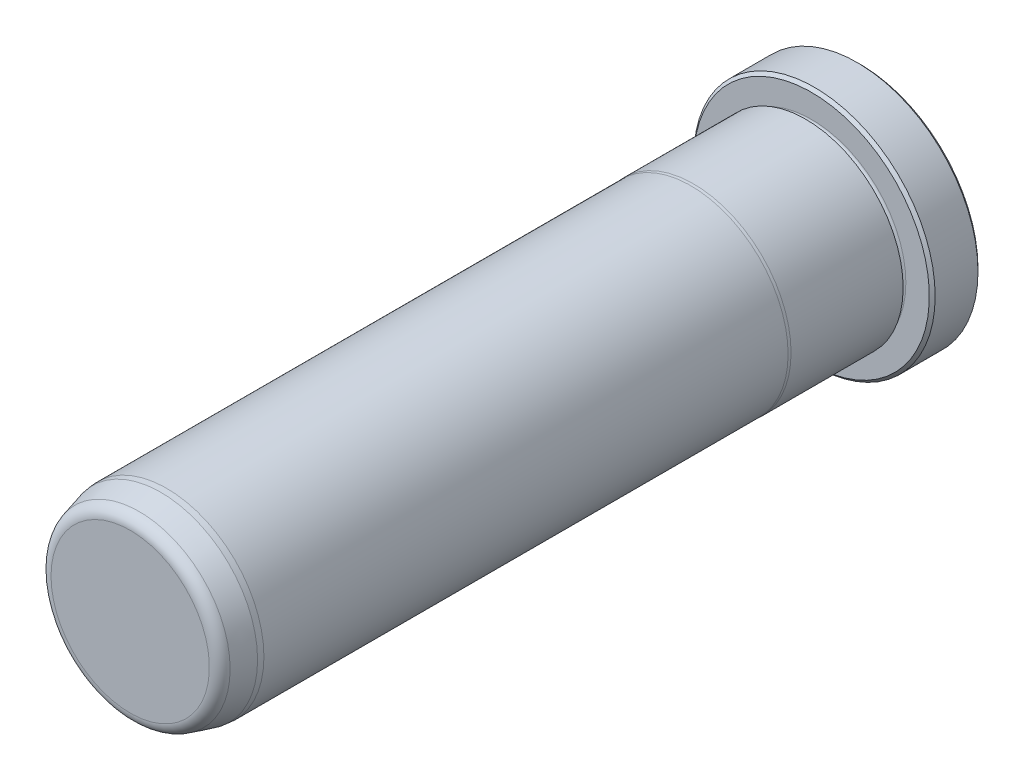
ISO-10303-21;
HEADER;
FILE_DESCRIPTION(('STEP AP214'),'2;1');
FILE_NAME('part.step','',(''),(''),'','','');
FILE_SCHEMA(('AUTOMOTIVE_DESIGN { 1 0 10303 214 1 1 1 1 }'));
ENDSEC;
DATA;
#1=APPLICATION_CONTEXT('core data for automotive mechanical design processes');
#2=APPLICATION_PROTOCOL_DEFINITION('international standard','automotive_design',2000,#1);
#3=PRODUCT_CONTEXT('',#1,'mechanical');
#4=PRODUCT('Part','Part','',(#3));
#5=PRODUCT_RELATED_PRODUCT_CATEGORY('part','',(#4));
#6=PRODUCT_DEFINITION_FORMATION('','',#4);
#7=PRODUCT_DEFINITION_CONTEXT('part definition',#1,'design');
#8=PRODUCT_DEFINITION('design','',#6,#7);
#9=PRODUCT_DEFINITION_SHAPE('','',#8);
#10=(LENGTH_UNIT() NAMED_UNIT(*) SI_UNIT(.MILLI.,.METRE.));
#11=(NAMED_UNIT(*) PLANE_ANGLE_UNIT() SI_UNIT($,.RADIAN.));
#12=(NAMED_UNIT(*) SI_UNIT($,.STERADIAN.) SOLID_ANGLE_UNIT());
#13=UNCERTAINTY_MEASURE_WITH_UNIT(LENGTH_MEASURE(1.E-05),#10,'distance_accuracy_value','');
#14=(GEOMETRIC_REPRESENTATION_CONTEXT(3) GLOBAL_UNCERTAINTY_ASSIGNED_CONTEXT((#13)) GLOBAL_UNIT_ASSIGNED_CONTEXT((#10,
#11,#12)) REPRESENTATION_CONTEXT('',''));
#15=CARTESIAN_POINT('',(0.,0.,0.));
#16=DIRECTION('',(0.,0.,1.));
#17=DIRECTION('',(1.,0.,0.));
#18=AXIS2_PLACEMENT_3D('',#15,#16,#17);
#19=CARTESIAN_POINT('',(0.,0.,0.));
#20=DIRECTION('',(0.,0.,1.));
#21=DIRECTION('',(1.,0.,0.));
#22=AXIS2_PLACEMENT_3D('',#19,#20,#21);
#23=PLANE('',#22);
#24=CARTESIAN_POINT('',(0.,0.,0.));
#25=DIRECTION('',(0.,0.,1.));
#26=DIRECTION('',(1.,0.,0.));
#27=AXIS2_PLACEMENT_3D('',#24,#25,#26);
#28=CIRCLE('',#27,15.367);
#29=CARTESIAN_POINT('',(15.367,0.,0.));
#30=VERTEX_POINT('',#29);
#31=EDGE_CURVE('E37',#30,#30,#28,.F.);
#32=ORIENTED_EDGE('',*,*,#31,.T.);
#33=EDGE_LOOP('',(#32));
#34=FACE_BOUND('',#33,.T.);
#35=ADVANCED_FACE('F30',(#34),#23,.F.);
#36=CARTESIAN_POINT('',(0.,0.,0.));
#37=DIRECTION('',(0.,0.,1.));
#38=DIRECTION('',(1.,0.,0.));
#39=AXIS2_PLACEMENT_3D('',#36,#37,#38);
#40=CYLINDRICAL_SURFACE('',#39,15.748);
#41=CARTESIAN_POINT('',(0.,0.,0.381000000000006));
#42=DIRECTION('',(0.,0.,1.));
#43=DIRECTION('',(1.,0.,0.));
#44=AXIS2_PLACEMENT_3D('',#41,#42,#43);
#45=CIRCLE('',#44,15.748);
#46=CARTESIAN_POINT('',(15.748,0.,0.381000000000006));
#47=VERTEX_POINT('',#46);
#48=EDGE_CURVE('E41',#47,#47,#45,.T.);
#49=ORIENTED_EDGE('',*,*,#48,.T.);
#50=EDGE_LOOP('',(#49));
#51=FACE_BOUND('',#50,.T.);
#52=CARTESIAN_POINT('',(0.,0.,5.96900000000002));
#53=DIRECTION('',(0.,0.,-1.));
#54=DIRECTION('',(-1.,0.,0.));
#55=AXIS2_PLACEMENT_3D('',#52,#53,#54);
#56=CIRCLE('',#55,15.748);
#57=CARTESIAN_POINT('',(-15.748,0.,5.96900000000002));
#58=VERTEX_POINT('',#57);
#59=EDGE_CURVE('E45',#58,#58,#56,.T.);
#60=ORIENTED_EDGE('',*,*,#59,.T.);
#61=EDGE_LOOP('',(#60));
#62=FACE_BOUND('',#61,.T.);
#63=ADVANCED_FACE('F118',(#51,#62),#40,.T.);
#64=CARTESIAN_POINT('',(0.,15.748,6.35));
#65=DIRECTION('',(0.,0.,-1.));
#66=DIRECTION('',(-1.,0.,0.));
#67=AXIS2_PLACEMENT_3D('',#64,#65,#66);
#68=PLANE('',#67);
#69=CARTESIAN_POINT('',(0.,0.,6.35));
#70=DIRECTION('',(0.,0.,-1.));
#71=DIRECTION('',(-1.,0.,0.));
#72=AXIS2_PLACEMENT_3D('',#69,#70,#71);
#73=CIRCLE('',#72,15.367);
#74=CARTESIAN_POINT('',(-15.367,0.,6.35));
#75=VERTEX_POINT('',#74);
#76=EDGE_CURVE('E10',#75,#75,#73,.F.);
#77=ORIENTED_EDGE('',*,*,#76,.T.);
#78=EDGE_LOOP('',(#77));
#79=FACE_BOUND('',#78,.T.);
#80=CARTESIAN_POINT('',(0.,0.,6.35));
#81=DIRECTION('',(0.,0.,1.));
#82=DIRECTION('',(1.,0.,0.));
#83=AXIS2_PLACEMENT_3D('',#80,#81,#82);
#84=CIRCLE('',#83,12.3063);
#85=CARTESIAN_POINT('',(12.3063,0.,6.35));
#86=VERTEX_POINT('',#85);
#87=EDGE_CURVE('E56',#86,#86,#84,.T.);
#88=ORIENTED_EDGE('',*,*,#87,.F.);
#89=EDGE_LOOP('',(#88));
#90=FACE_BOUND('',#89,.T.);
#91=ADVANCED_FACE('F113',(#79,#90),#68,.F.);
#92=CARTESIAN_POINT('',(0.,0.,6.731));
#93=DIRECTION('',(0.,0.,1.));
#94=DIRECTION('',(1.,0.,0.));
#95=AXIS2_PLACEMENT_3D('',#92,#93,#94);
#96=TOROIDAL_SURFACE('',#95,12.3063,0.381);
#97=CARTESIAN_POINT('',(0.,0.,7.112));
#98=DIRECTION('',(0.,0.,1.));
#99=DIRECTION('',(1.,0.,0.));
#100=AXIS2_PLACEMENT_3D('',#97,#98,#99);
#101=CIRCLE('',#100,12.3063);
#102=CARTESIAN_POINT('',(12.3063,0.,7.112));
#103=VERTEX_POINT('',#102);
#104=EDGE_CURVE('E59',#103,#103,#101,.T.);
#105=ORIENTED_EDGE('',*,*,#104,.F.);
#106=EDGE_LOOP('',(#105));
#107=FACE_BOUND('',#106,.T.);
#108=ORIENTED_EDGE('',*,*,#87,.T.);
#109=EDGE_LOOP('',(#108));
#110=FACE_BOUND('',#109,.T.);
#111=ADVANCED_FACE('F107',(#107,#110),#96,.F.);
#112=CARTESIAN_POINT('',(0.,12.3063,7.112));
#113=DIRECTION('',(0.,0.,1.));
#114=DIRECTION('',(1.,0.,0.));
#115=AXIS2_PLACEMENT_3D('',#112,#113,#114);
#116=PLANE('',#115);
#117=CARTESIAN_POINT('',(0.,0.,7.112));
#118=DIRECTION('',(0.,0.,1.));
#119=DIRECTION('',(1.,0.,0.));
#120=AXIS2_PLACEMENT_3D('',#117,#118,#119);
#121=CIRCLE('',#120,12.7127);
#122=CARTESIAN_POINT('',(12.7127,0.,7.112));
#123=VERTEX_POINT('',#122);
#124=EDGE_CURVE('E62',#123,#123,#121,.T.);
#125=ORIENTED_EDGE('',*,*,#124,.F.);
#126=EDGE_LOOP('',(#125));
#127=FACE_BOUND('',#126,.T.);
#128=ORIENTED_EDGE('',*,*,#104,.T.);
#129=EDGE_LOOP('',(#128));
#130=FACE_BOUND('',#129,.T.);
#131=ADVANCED_FACE('F101',(#127,#130),#116,.F.);
#132=CARTESIAN_POINT('',(0.,0.,0.));
#133=DIRECTION('',(0.,0.,1.));
#134=DIRECTION('',(1.,0.,0.));
#135=AXIS2_PLACEMENT_3D('',#132,#133,#134);
#136=CYLINDRICAL_SURFACE('',#135,12.7127);
#137=CARTESIAN_POINT('',(0.,0.,21.7347630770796));
#138=DIRECTION('',(0.,0.,1.));
#139=DIRECTION('',(1.,0.,0.));
#140=AXIS2_PLACEMENT_3D('',#137,#138,#139);
#141=CIRCLE('',#140,12.7127);
#142=CARTESIAN_POINT('',(12.7127,0.,21.7347630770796));
#143=VERTEX_POINT('',#142);
#144=EDGE_CURVE('E65',#143,#143,#141,.T.);
#145=ORIENTED_EDGE('',*,*,#144,.F.);
#146=EDGE_LOOP('',(#145));
#147=FACE_BOUND('',#146,.T.);
#148=ORIENTED_EDGE('',*,*,#124,.T.);
#149=EDGE_LOOP('',(#148));
#150=FACE_BOUND('',#149,.T.);
#151=ADVANCED_FACE('F95',(#147,#150),#136,.T.);
#152=CARTESIAN_POINT('',(0.,0.,21.7347630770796));
#153=DIRECTION('',(0.,0.,-1.));
#154=DIRECTION('',(-1.,0.,0.));
#155=AXIS2_PLACEMENT_3D('',#152,#153,#154);
#156=CONICAL_SURFACE('',#155,12.7127,0.069813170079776);
#157=CARTESIAN_POINT('',(0.,0.,22.098));
#158=DIRECTION('',(0.,0.,1.));
#159=DIRECTION('',(1.,0.,0.));
#160=AXIS2_PLACEMENT_3D('',#157,#158,#159);
#161=CIRCLE('',#160,12.6873);
#162=CARTESIAN_POINT('',(12.6873,0.,22.098));
#163=VERTEX_POINT('',#162);
#164=EDGE_CURVE('E68',#163,#163,#161,.T.);
#165=ORIENTED_EDGE('',*,*,#164,.F.);
#166=EDGE_LOOP('',(#165));
#167=FACE_BOUND('',#166,.T.);
#168=ORIENTED_EDGE('',*,*,#144,.T.);
#169=EDGE_LOOP('',(#168));
#170=FACE_BOUND('',#169,.T.);
#171=ADVANCED_FACE('F89',(#167,#170),#156,.T.);
#172=CARTESIAN_POINT('',(0.,0.,0.));
#173=DIRECTION('',(0.,0.,1.));
#174=DIRECTION('',(1.,0.,0.));
#175=AXIS2_PLACEMENT_3D('',#172,#173,#174);
#176=CYLINDRICAL_SURFACE('',#175,12.6873);
#177=CARTESIAN_POINT('',(0.,0.,90.4875));
#178=DIRECTION('',(0.,0.,1.));
#179=DIRECTION('',(1.,0.,0.));
#180=AXIS2_PLACEMENT_3D('',#177,#178,#179);
#181=CIRCLE('',#180,12.6873);
#182=CARTESIAN_POINT('',(12.6873,0.,90.4875));
#183=VERTEX_POINT('',#182);
#184=EDGE_CURVE('E71',#183,#183,#181,.T.);
#185=ORIENTED_EDGE('',*,*,#184,.F.);
#186=EDGE_LOOP('',(#185));
#187=FACE_BOUND('',#186,.T.);
#188=ORIENTED_EDGE('',*,*,#164,.T.);
#189=EDGE_LOOP('',(#188));
#190=FACE_BOUND('',#189,.T.);
#191=ADVANCED_FACE('F83',(#187,#190),#176,.T.);
#192=CARTESIAN_POINT('',(0.,0.,90.4875));
#193=DIRECTION('',(0.,0.,-1.));
#194=DIRECTION('',(-1.,0.,0.));
#195=AXIS2_PLACEMENT_3D('',#192,#193,#194);
#196=CONICAL_SURFACE('',#195,12.6873,0.0872664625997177);
#197=CARTESIAN_POINT('',(0.,0.,91.2495));
#198=DIRECTION('',(0.,0.,1.));
#199=DIRECTION('',(1.,0.,0.));
#200=AXIS2_PLACEMENT_3D('',#197,#198,#199);
#201=CIRCLE('',#200,12.6206336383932);
#202=CARTESIAN_POINT('',(12.6206336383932,0.,91.2495));
#203=VERTEX_POINT('',#202);
#204=EDGE_CURVE('E74',#203,#203,#201,.T.);
#205=ORIENTED_EDGE('',*,*,#204,.F.);
#206=EDGE_LOOP('',(#205));
#207=FACE_BOUND('',#206,.T.);
#208=ORIENTED_EDGE('',*,*,#184,.T.);
#209=EDGE_LOOP('',(#208));
#210=FACE_BOUND('',#209,.T.);
#211=ADVANCED_FACE('F80',(#207,#210),#196,.T.);
#212=CARTESIAN_POINT('',(0.,0.,91.2495));
#213=DIRECTION('',(0.,0.,-1.));
#214=DIRECTION('',(-1.,0.,0.));
#215=AXIS2_PLACEMENT_3D('',#212,#213,#214);
#216=CONICAL_SURFACE('',#215,12.6206336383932,0.26179938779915);
#217=CARTESIAN_POINT('',(0.,0.,94.0733752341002));
#218=DIRECTION('',(0.,0.,1.));
#219=DIRECTION('',(1.,0.,0.));
#220=AXIS2_PLACEMENT_3D('',#217,#218,#219);
#221=CIRCLE('',#220,11.8639785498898);
#222=CARTESIAN_POINT('',(11.8639785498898,0.,94.0733752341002));
#223=VERTEX_POINT('',#222);
#224=EDGE_CURVE('E50',#223,#223,#221,.F.);
#225=ORIENTED_EDGE('',*,*,#224,.T.);
#226=EDGE_LOOP('',(#225));
#227=FACE_BOUND('',#226,.T.);
#228=ORIENTED_EDGE('',*,*,#204,.T.);
#229=EDGE_LOOP('',(#228));
#230=FACE_BOUND('',#229,.T.);
#231=ADVANCED_FACE('F78',(#227,#230),#216,.T.);
#232=CARTESIAN_POINT('',(0.,11.5487028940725,95.25));
#233=DIRECTION('',(0.,0.,-1.));
#234=DIRECTION('',(-1.,0.,0.));
#235=AXIS2_PLACEMENT_3D('',#232,#233,#234);
#236=PLANE('',#235);
#237=CARTESIAN_POINT('',(0.,0.,95.25));
#238=DIRECTION('',(0.,0.,-1.));
#239=DIRECTION('',(-1.,0.,0.));
#240=AXIS2_PLACEMENT_3D('',#237,#238,#239);
#241=CIRCLE('',#240,10.3305713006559);
#242=CARTESIAN_POINT('',(-10.3305713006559,0.,95.25));
#243=VERTEX_POINT('',#242);
#244=EDGE_CURVE('E53',#243,#243,#241,.F.);
#245=ORIENTED_EDGE('',*,*,#244,.T.);
#246=EDGE_LOOP('',(#245));
#247=FACE_BOUND('',#246,.T.);
#248=ADVANCED_FACE('F133',(#247),#236,.F.);
#249=CARTESIAN_POINT('',(0.,0.,93.6625));
#250=DIRECTION('',(0.,0.,-1.));
#251=DIRECTION('',(-1.,0.,0.));
#252=AXIS2_PLACEMENT_3D('',#249,#250,#251);
#253=TOROIDAL_SURFACE('',#252,10.3305713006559,1.5875);
#254=ORIENTED_EDGE('',*,*,#224,.F.);
#255=EDGE_LOOP('',(#254));
#256=FACE_BOUND('',#255,.T.);
#257=ORIENTED_EDGE('',*,*,#244,.F.);
#258=EDGE_LOOP('',(#257));
#259=FACE_BOUND('',#258,.T.);
#260=ADVANCED_FACE('F130',(#256,#259),#253,.T.);
#261=CARTESIAN_POINT('',(0.,0.,0.381000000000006));
#262=DIRECTION('',(0.,0.,1.));
#263=DIRECTION('',(1.,0.,0.));
#264=AXIS2_PLACEMENT_3D('',#261,#262,#263);
#265=CONICAL_SURFACE('',#264,15.748,0.785398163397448);
#266=CARTESIAN_POINT('',(15.367,0.,0.));
#267=CARTESIAN_POINT('',(15.37096875,0.,0.00396874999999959));
#268=CARTESIAN_POINT('',(15.3749375,0.,0.00793749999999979));
#269=CARTESIAN_POINT('',(15.382875,0.,0.0158750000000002));
#270=CARTESIAN_POINT('',(15.38684375,0.,0.0198437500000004));
#271=CARTESIAN_POINT('',(15.39478125,0.,0.0277812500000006));
#272=CARTESIAN_POINT('',(15.39875,0.,0.0317500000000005));
#273=CARTESIAN_POINT('',(15.4066875,0.,0.0396875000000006));
#274=CARTESIAN_POINT('',(15.41065625,0.,0.0436562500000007));
#275=CARTESIAN_POINT('',(15.41859375,0.,0.0515937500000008));
#276=CARTESIAN_POINT('',(15.4225625,0.,0.0555625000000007));
#277=CARTESIAN_POINT('',(15.4305,0.,0.0635000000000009));
#278=CARTESIAN_POINT('',(15.43446875,0.,0.0674687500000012));
#279=CARTESIAN_POINT('',(15.44240625,0.,0.0754062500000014));
#280=CARTESIAN_POINT('',(15.446375,0.,0.0793750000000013));
#281=CARTESIAN_POINT('',(15.4543125,0.,0.0873125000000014));
#282=CARTESIAN_POINT('',(15.45828125,0.,0.0912812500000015));
#283=CARTESIAN_POINT('',(15.46621875,0.,0.0992187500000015));
#284=CARTESIAN_POINT('',(15.4701875,0.,0.103187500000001));
#285=CARTESIAN_POINT('',(15.478125,0.,0.111125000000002));
#286=CARTESIAN_POINT('',(15.48209375,0.,0.115093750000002));
#287=CARTESIAN_POINT('',(15.49003125,0.,0.123031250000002));
#288=CARTESIAN_POINT('',(15.494,0.,0.127000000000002));
#289=CARTESIAN_POINT('',(15.5019375,0.,0.134937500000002));
#290=CARTESIAN_POINT('',(15.50590625,0.,0.138906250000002));
#291=CARTESIAN_POINT('',(15.51384375,0.,0.146843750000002));
#292=CARTESIAN_POINT('',(15.5178125,0.,0.150812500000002));
#293=CARTESIAN_POINT('',(15.52575,0.,0.158750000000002));
#294=CARTESIAN_POINT('',(15.52971875,0.,0.162718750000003));
#295=CARTESIAN_POINT('',(15.53765625,0.,0.170656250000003));
#296=CARTESIAN_POINT('',(15.541625,0.,0.174625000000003));
#297=CARTESIAN_POINT('',(15.5495625,0.,0.182562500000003));
#298=CARTESIAN_POINT('',(15.55353125,0.,0.186531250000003));
#299=CARTESIAN_POINT('',(15.56146875,0.,0.194468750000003));
#300=CARTESIAN_POINT('',(15.5654375,0.,0.198437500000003));
#301=CARTESIAN_POINT('',(15.573375,0.,0.206375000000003));
#302=CARTESIAN_POINT('',(15.57734375,0.,0.210343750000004));
#303=CARTESIAN_POINT('',(15.58528125,0.,0.218281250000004));
#304=CARTESIAN_POINT('',(15.58925,0.,0.222250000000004));
#305=CARTESIAN_POINT('',(15.5971875,0.,0.230187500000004));
#306=CARTESIAN_POINT('',(15.60115625,0.,0.234156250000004));
#307=CARTESIAN_POINT('',(15.60909375,0.,0.242093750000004));
#308=CARTESIAN_POINT('',(15.6130625,0.,0.246062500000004));
#309=CARTESIAN_POINT('',(15.621,0.,0.254000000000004));
#310=CARTESIAN_POINT('',(15.62496875,0.,0.257968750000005));
#311=CARTESIAN_POINT('',(15.63290625,0.,0.265906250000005));
#312=CARTESIAN_POINT('',(15.636875,0.,0.269875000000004));
#313=CARTESIAN_POINT('',(15.6448125,0.,0.277812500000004));
#314=CARTESIAN_POINT('',(15.64878125,0.,0.281781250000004));
#315=CARTESIAN_POINT('',(15.65671875,0.,0.289718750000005));
#316=CARTESIAN_POINT('',(15.6606875,0.,0.293687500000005));
#317=CARTESIAN_POINT('',(15.668625,0.,0.301625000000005));
#318=CARTESIAN_POINT('',(15.67259375,0.,0.305593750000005));
#319=CARTESIAN_POINT('',(15.68053125,0.,0.313531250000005));
#320=CARTESIAN_POINT('',(15.6845,0.,0.317500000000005));
#321=CARTESIAN_POINT('',(15.6924375,0.,0.325437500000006));
#322=CARTESIAN_POINT('',(15.69640625,0.,0.329406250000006));
#323=CARTESIAN_POINT('',(15.70434375,0.,0.337343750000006));
#324=CARTESIAN_POINT('',(15.7083125,0.,0.341312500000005));
#325=CARTESIAN_POINT('',(15.71625,0.,0.349250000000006));
#326=CARTESIAN_POINT('',(15.72021875,0.,0.353218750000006));
#327=CARTESIAN_POINT('',(15.72815625,0.,0.361156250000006));
#328=CARTESIAN_POINT('',(15.732125,0.,0.365125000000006));
#329=CARTESIAN_POINT('',(15.7400625,0.,0.373062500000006));
#330=CARTESIAN_POINT('',(15.74403125,0.,0.377031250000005));
#331=CARTESIAN_POINT('',(15.748,0.,0.381000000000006));
#332=B_SPLINE_CURVE_WITH_KNOTS('',3,(#266,#267,#268,#269,#270,#271,#272,#273,#274,#275,#276,
#277,#278,#279,#280,#281,#282,#283,#284,#285,#286,#287,#288,#289,#290,#291,#292,#293,#294,#295,
#296,#297,#298,#299,#300,#301,#302,#303,#304,#305,#306,#307,#308,#309,#310,#311,#312,#313,#314,
#315,#316,#317,#318,#319,#320,#321,#322,#323,#324,#325,#326,#327,#328,#329,#330,#331),
.UNSPECIFIED.,.F.,.F.,(4,2,2,2,2,2,2,2,2,2,2,2,2,2,2,2,2,2,2,2,2,2,2,2,2,2,2,2,2,2,2,2,4),(0.,
0.0168379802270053,0.0336759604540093,0.0505139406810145,0.0673519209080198,0.084189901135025,
0.101027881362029,0.117865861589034,0.13470384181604,0.151541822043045,0.168379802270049,
0.185217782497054,0.202055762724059,0.218893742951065,0.235731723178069,0.252569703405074,
0.269407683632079,0.286245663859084,0.303083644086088,0.319921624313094,0.336759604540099,
0.353597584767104,0.370435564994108,0.387273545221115,0.404111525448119,0.420949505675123,
0.437787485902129,0.454625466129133,0.471463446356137,0.488301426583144,0.505139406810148,
0.521977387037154,0.538815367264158),.UNSPECIFIED.);
#333=EDGE_CURVE('BSEAM132',#30,#47,#332,.T.);
#334=ORIENTED_EDGE('',*,*,#31,.F.);
#335=ORIENTED_EDGE('',*,*,#48,.F.);
#336=ORIENTED_EDGE('',*,*,#333,.T.);
#337=ORIENTED_EDGE('',*,*,#333,.F.);
#338=EDGE_LOOP('',(#334,#336,#335,#337));
#339=FACE_BOUND('',#338,.T.);
#340=ADVANCED_FACE('F132',(#339),#265,.T.);
#341=CARTESIAN_POINT('',(0.,0.,6.35));
#342=DIRECTION('',(0.,0.,-1.));
#343=DIRECTION('',(-1.,0.,0.));
#344=AXIS2_PLACEMENT_3D('',#341,#342,#343);
#345=CONICAL_SURFACE('',#344,15.367,0.785398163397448);
#346=ORIENTED_EDGE('',*,*,#59,.F.);
#347=EDGE_LOOP('',(#346));
#348=FACE_BOUND('',#347,.T.);
#349=ORIENTED_EDGE('',*,*,#76,.F.);
#350=EDGE_LOOP('',(#349));
#351=FACE_BOUND('',#350,.T.);
#352=ADVANCED_FACE('F32',(#348,#351),#345,.T.);
#353=CLOSED_SHELL('',(#35,#63,#91,#111,#131,#151,#171,#191,#211,#231,#248,#260,#340,#352));
#354=MANIFOLD_SOLID_BREP('B2',#353);
#355=ADVANCED_BREP_SHAPE_REPRESENTATION('',(#18,#354),#14);
#356=SHAPE_DEFINITION_REPRESENTATION(#9,#355);
ENDSEC;
END-ISO-10303-21;
